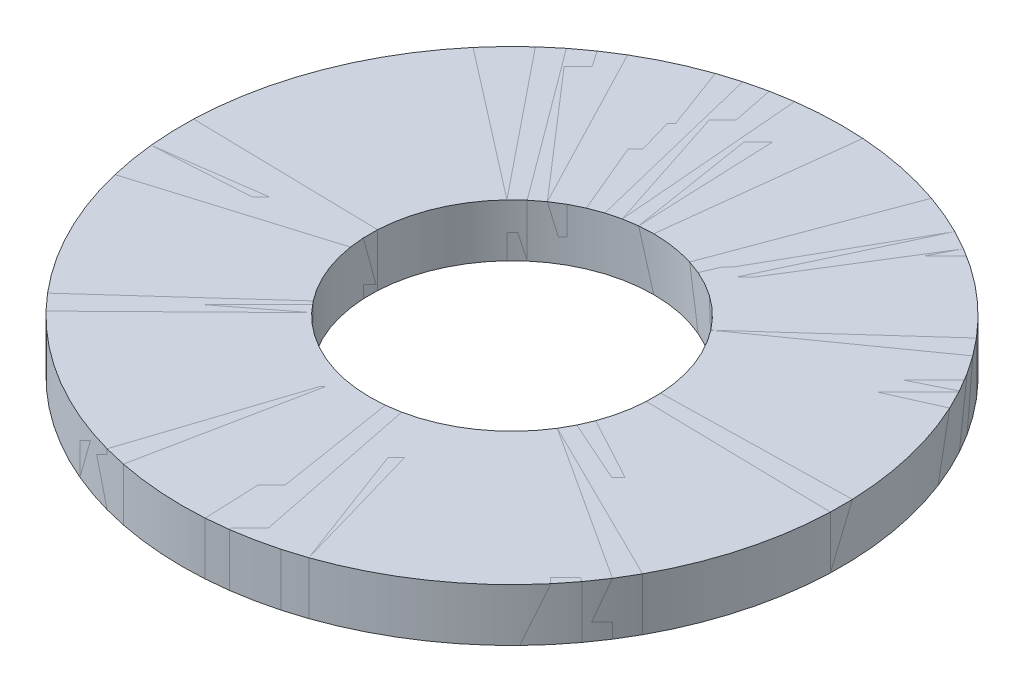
ISO-10303-21;
HEADER;
FILE_DESCRIPTION(('STEP AP214'),'2;1');
FILE_NAME('part.step','',(''),(''),'','','');
FILE_SCHEMA(('AUTOMOTIVE_DESIGN { 1 0 10303 214 1 1 1 1 }'));
ENDSEC;
DATA;
#1=APPLICATION_CONTEXT('core data for automotive mechanical design processes');
#2=APPLICATION_PROTOCOL_DEFINITION('international standard','automotive_design',2000,#1);
#3=PRODUCT_CONTEXT('',#1,'mechanical');
#4=PRODUCT('Part','Part','',(#3));
#5=PRODUCT_RELATED_PRODUCT_CATEGORY('part','',(#4));
#6=PRODUCT_DEFINITION_FORMATION('','',#4);
#7=PRODUCT_DEFINITION_CONTEXT('part definition',#1,'design');
#8=PRODUCT_DEFINITION('design','',#6,#7);
#9=PRODUCT_DEFINITION_SHAPE('','',#8);
#10=(LENGTH_UNIT() NAMED_UNIT(*) SI_UNIT(.MILLI.,.METRE.));
#11=(NAMED_UNIT(*) PLANE_ANGLE_UNIT() SI_UNIT($,.RADIAN.));
#12=(NAMED_UNIT(*) SI_UNIT($,.STERADIAN.) SOLID_ANGLE_UNIT());
#13=UNCERTAINTY_MEASURE_WITH_UNIT(LENGTH_MEASURE(1.E-05),#10,'distance_accuracy_value','');
#14=(GEOMETRIC_REPRESENTATION_CONTEXT(3) GLOBAL_UNCERTAINTY_ASSIGNED_CONTEXT((#13)) GLOBAL_UNIT_ASSIGNED_CONTEXT((#10,
#11,#12)) REPRESENTATION_CONTEXT('',''));
#15=CARTESIAN_POINT('',(0.,0.,0.));
#16=DIRECTION('',(0.,0.,1.));
#17=DIRECTION('',(1.,0.,0.));
#18=AXIS2_PLACEMENT_3D('',#15,#16,#17);
#19=CARTESIAN_POINT('',(0.,0.,0.));
#20=DIRECTION('',(0.,-1.,0.));
#21=DIRECTION('',(0.,0.,-1.));
#22=AXIS2_PLACEMENT_3D('',#19,#20,#21);
#23=CYLINDRICAL_SURFACE('',#22,2.15);
#24=CARTESIAN_POINT('',(0.,0.800000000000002,0.));
#25=DIRECTION('',(0.,-1.,0.));
#26=DIRECTION('',(0.,0.,-1.));
#27=AXIS2_PLACEMENT_3D('',#24,#25,#26);
#28=CIRCLE('',#27,2.15);
#29=CARTESIAN_POINT('',(0.,0.800000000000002,-2.15000000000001));
#30=VERTEX_POINT('',#29);
#31=EDGE_CURVE('P0_E10',#30,#30,#28,.T.);
#32=ORIENTED_EDGE('',*,*,#31,.F.);
#33=EDGE_LOOP('',(#32));
#34=FACE_BOUND('',#33,.T.);
#35=CARTESIAN_POINT('',(0.,0.,0.));
#36=DIRECTION('',(0.,-1.,0.));
#37=DIRECTION('',(0.,0.,-1.));
#38=AXIS2_PLACEMENT_3D('',#35,#36,#37);
#39=CIRCLE('',#38,2.15);
#40=CARTESIAN_POINT('',(0.,0.,-2.15000000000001));
#41=VERTEX_POINT('',#40);
#42=EDGE_CURVE('P0_E362',#41,#41,#39,.T.);
#43=ORIENTED_EDGE('',*,*,#42,.T.);
#44=EDGE_LOOP('',(#43));
#45=FACE_BOUND('',#44,.T.);
#46=ADVANCED_FACE('P0_F348',(#34,#45),#23,.F.);
#47=CARTESIAN_POINT('',(5.00000000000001,0.800000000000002,0.));
#48=DIRECTION('',(0.,1.,0.));
#49=DIRECTION('',(0.,0.,1.));
#50=AXIS2_PLACEMENT_3D('',#47,#48,#49);
#51=PLANE('',#50);
#52=ORIENTED_EDGE('',*,*,#31,.T.);
#53=EDGE_LOOP('',(#52));
#54=FACE_BOUND('',#53,.T.);
#55=CARTESIAN_POINT('',(0.,0.800000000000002,0.));
#56=DIRECTION('',(0.,-1.,0.));
#57=DIRECTION('',(0.,0.,-1.));
#58=AXIS2_PLACEMENT_3D('',#55,#56,#57);
#59=CIRCLE('',#58,5.);
#60=CARTESIAN_POINT('',(0.,0.800000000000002,-5.00000000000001));
#61=VERTEX_POINT('',#60);
#62=EDGE_CURVE('P0_E354',#61,#61,#59,.T.);
#63=ORIENTED_EDGE('',*,*,#62,.F.);
#64=EDGE_LOOP('',(#63));
#65=FACE_BOUND('',#64,.T.);
#66=ADVANCED_FACE('P0_F377',(#54,#65),#51,.T.);
#67=CARTESIAN_POINT('',(0.,0.,0.));
#68=DIRECTION('',(0.,-1.,0.));
#69=DIRECTION('',(0.,0.,-1.));
#70=AXIS2_PLACEMENT_3D('',#67,#68,#69);
#71=CYLINDRICAL_SURFACE('',#70,5.);
#72=ORIENTED_EDGE('',*,*,#62,.T.);
#73=EDGE_LOOP('',(#72));
#74=FACE_BOUND('',#73,.T.);
#75=CARTESIAN_POINT('',(0.,0.,0.));
#76=DIRECTION('',(0.,-1.,0.));
#77=DIRECTION('',(0.,0.,-1.));
#78=AXIS2_PLACEMENT_3D('',#75,#76,#77);
#79=CIRCLE('',#78,5.);
#80=CARTESIAN_POINT('',(0.,0.,-5.00000000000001));
#81=VERTEX_POINT('',#80);
#82=EDGE_CURVE('P0_E358',#81,#81,#79,.T.);
#83=ORIENTED_EDGE('',*,*,#82,.F.);
#84=EDGE_LOOP('',(#83));
#85=FACE_BOUND('',#84,.T.);
#86=ADVANCED_FACE('P0_F371',(#74,#85),#71,.T.);
#87=CARTESIAN_POINT('',(2.15,0.,0.));
#88=DIRECTION('',(0.,-1.,0.));
#89=DIRECTION('',(0.,0.,-1.));
#90=AXIS2_PLACEMENT_3D('',#87,#88,#89);
#91=PLANE('',#90);
#92=ORIENTED_EDGE('',*,*,#82,.T.);
#93=EDGE_LOOP('',(#92));
#94=FACE_BOUND('',#93,.T.);
#95=ORIENTED_EDGE('',*,*,#42,.F.);
#96=EDGE_LOOP('',(#95));
#97=FACE_BOUND('',#96,.T.);
#98=ADVANCED_FACE('P0_F369',(#94,#97),#91,.T.);
#99=CLOSED_SHELL('',(#46,#66,#86,#98));
#100=MANIFOLD_SOLID_BREP('P0_B2',#99);
#101=CARTESIAN_POINT('',(0.,0.,0.));
#102=DIRECTION('',(0.,-1.,0.));
#103=DIRECTION('',(0.,0.,-1.));
#104=AXIS2_PLACEMENT_3D('',#101,#102,#103);
#105=CYLINDRICAL_SURFACE('',#104,2.15);
#106=CARTESIAN_POINT('',(0.,0.800000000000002,0.));
#107=DIRECTION('',(0.,-1.,0.));
#108=DIRECTION('',(0.,0.,-1.));
#109=AXIS2_PLACEMENT_3D('',#106,#107,#108);
#110=CIRCLE('',#109,2.15);
#111=CARTESIAN_POINT('',(0.,0.800000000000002,-2.15));
#112=VERTEX_POINT('',#111);
#113=EDGE_CURVE('P1_E9',#112,#112,#110,.T.);
#114=ORIENTED_EDGE('',*,*,#113,.F.);
#115=EDGE_LOOP('',(#114));
#116=FACE_BOUND('',#115,.T.);
#117=CARTESIAN_POINT('',(0.,0.,0.));
#118=DIRECTION('',(0.,-1.,0.));
#119=DIRECTION('',(0.,0.,-1.));
#120=AXIS2_PLACEMENT_3D('',#117,#118,#119);
#121=CIRCLE('',#120,2.15);
#122=CARTESIAN_POINT('',(0.,0.,-2.15));
#123=VERTEX_POINT('',#122);
#124=EDGE_CURVE('P1_E27',#123,#123,#121,.T.);
#125=ORIENTED_EDGE('',*,*,#124,.T.);
#126=EDGE_LOOP('',(#125));
#127=FACE_BOUND('',#126,.T.);
#128=ADVANCED_FACE('P1_F13',(#116,#127),#105,.F.);
#129=CARTESIAN_POINT('',(5.,0.800000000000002,0.));
#130=DIRECTION('',(0.,1.,0.));
#131=DIRECTION('',(0.,0.,1.));
#132=AXIS2_PLACEMENT_3D('',#129,#130,#131);
#133=PLANE('',#132);
#134=ORIENTED_EDGE('',*,*,#113,.T.);
#135=EDGE_LOOP('',(#134));
#136=FACE_BOUND('',#135,.T.);
#137=CARTESIAN_POINT('',(0.,0.800000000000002,0.));
#138=DIRECTION('',(0.,-1.,0.));
#139=DIRECTION('',(0.,0.,-1.));
#140=AXIS2_PLACEMENT_3D('',#137,#138,#139);
#141=CIRCLE('',#140,5.);
#142=CARTESIAN_POINT('',(0.,0.800000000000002,-5.));
#143=VERTEX_POINT('',#142);
#144=EDGE_CURVE('P1_E19',#143,#143,#141,.T.);
#145=ORIENTED_EDGE('',*,*,#144,.F.);
#146=EDGE_LOOP('',(#145));
#147=FACE_BOUND('',#146,.T.);
#148=ADVANCED_FACE('P1_F38',(#136,#147),#133,.T.);
#149=CARTESIAN_POINT('',(0.,0.,0.));
#150=DIRECTION('',(0.,-1.,0.));
#151=DIRECTION('',(0.,0.,-1.));
#152=AXIS2_PLACEMENT_3D('',#149,#150,#151);
#153=CYLINDRICAL_SURFACE('',#152,5.);
#154=ORIENTED_EDGE('',*,*,#144,.T.);
#155=EDGE_LOOP('',(#154));
#156=FACE_BOUND('',#155,.T.);
#157=CARTESIAN_POINT('',(0.,0.,0.));
#158=DIRECTION('',(0.,-1.,0.));
#159=DIRECTION('',(0.,0.,-1.));
#160=AXIS2_PLACEMENT_3D('',#157,#158,#159);
#161=CIRCLE('',#160,5.);
#162=CARTESIAN_POINT('',(0.,0.,-5.));
#163=VERTEX_POINT('',#162);
#164=EDGE_CURVE('P1_E23',#163,#163,#161,.T.);
#165=ORIENTED_EDGE('',*,*,#164,.F.);
#166=EDGE_LOOP('',(#165));
#167=FACE_BOUND('',#166,.T.);
#168=ADVANCED_FACE('P1_F35',(#156,#167),#153,.T.);
#169=CARTESIAN_POINT('',(2.15,0.,0.));
#170=DIRECTION('',(0.,-1.,0.));
#171=DIRECTION('',(0.,0.,-1.));
#172=AXIS2_PLACEMENT_3D('',#169,#170,#171);
#173=PLANE('',#172);
#174=ORIENTED_EDGE('',*,*,#164,.T.);
#175=EDGE_LOOP('',(#174));
#176=FACE_BOUND('',#175,.T.);
#177=ORIENTED_EDGE('',*,*,#124,.F.);
#178=EDGE_LOOP('',(#177));
#179=FACE_BOUND('',#178,.T.);
#180=ADVANCED_FACE('P1_F34',(#176,#179),#173,.T.);
#181=CLOSED_SHELL('',(#128,#148,#168,#180));
#182=MANIFOLD_SOLID_BREP('P1_B1',#181);
#183=ADVANCED_BREP_SHAPE_REPRESENTATION('',(#18,#100,#182),#14);
#184=SHAPE_DEFINITION_REPRESENTATION(#9,#183);
ENDSEC;
END-ISO-10303-21;
